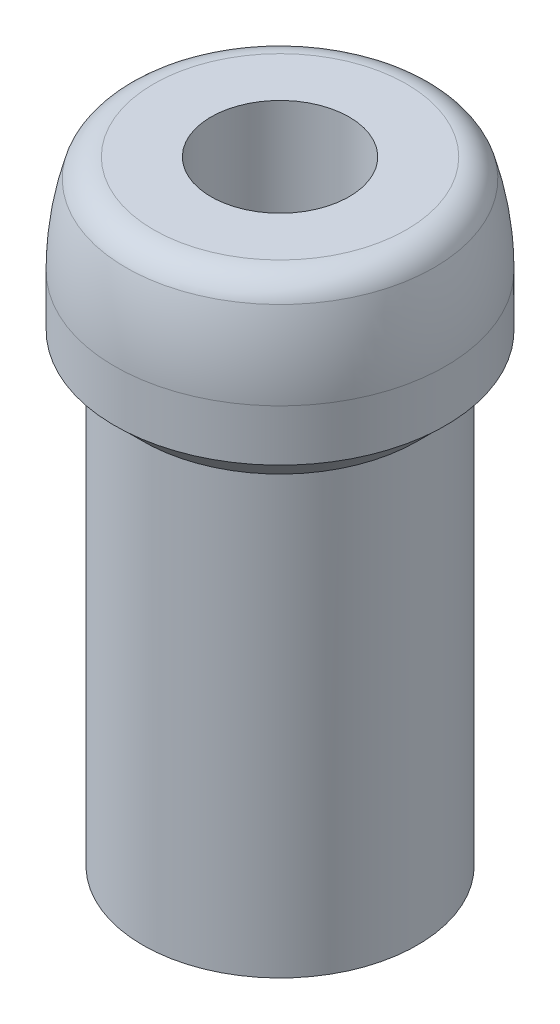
ISO-10303-21;
HEADER;
FILE_DESCRIPTION(('STEP AP214'),'2;1');
FILE_NAME('part.step','',(''),(''),'','','');
FILE_SCHEMA(('AUTOMOTIVE_DESIGN { 1 0 10303 214 1 1 1 1 }'));
ENDSEC;
DATA;
#1=APPLICATION_CONTEXT('core data for automotive mechanical design processes');
#2=APPLICATION_PROTOCOL_DEFINITION('international standard','automotive_design',2000,#1);
#3=PRODUCT_CONTEXT('',#1,'mechanical');
#4=PRODUCT('Part','Part','',(#3));
#5=PRODUCT_RELATED_PRODUCT_CATEGORY('part','',(#4));
#6=PRODUCT_DEFINITION_FORMATION('','',#4);
#7=PRODUCT_DEFINITION_CONTEXT('part definition',#1,'design');
#8=PRODUCT_DEFINITION('design','',#6,#7);
#9=PRODUCT_DEFINITION_SHAPE('','',#8);
#10=(LENGTH_UNIT() NAMED_UNIT(*) SI_UNIT(.MILLI.,.METRE.));
#11=(NAMED_UNIT(*) PLANE_ANGLE_UNIT() SI_UNIT($,.RADIAN.));
#12=(NAMED_UNIT(*) SI_UNIT($,.STERADIAN.) SOLID_ANGLE_UNIT());
#13=UNCERTAINTY_MEASURE_WITH_UNIT(LENGTH_MEASURE(1.E-05),#10,'distance_accuracy_value','');
#14=(GEOMETRIC_REPRESENTATION_CONTEXT(3) GLOBAL_UNCERTAINTY_ASSIGNED_CONTEXT((#13)) GLOBAL_UNIT_ASSIGNED_CONTEXT((#10,
#11,#12)) REPRESENTATION_CONTEXT('',''));
#15=CARTESIAN_POINT('',(0.,0.,0.));
#16=DIRECTION('',(0.,0.,1.));
#17=DIRECTION('',(1.,0.,0.));
#18=AXIS2_PLACEMENT_3D('',#15,#16,#17);
#19=CARTESIAN_POINT('',(0.,23.5,0.));
#20=DIRECTION('',(0.,-1.,0.));
#21=DIRECTION('',(0.,0.,-1.));
#22=AXIS2_PLACEMENT_3D('',#19,#20,#21);
#23=CYLINDRICAL_SURFACE('',#22,6.95);
#24=CARTESIAN_POINT('',(0.,22.1,0.));
#25=DIRECTION('',(0.,-1.,0.));
#26=DIRECTION('',(0.,0.,-1.));
#27=AXIS2_PLACEMENT_3D('',#24,#25,#26);
#28=CIRCLE('',#27,6.95);
#29=CARTESIAN_POINT('',(0.,22.1,-6.95));
#30=VERTEX_POINT('',#29);
#31=EDGE_CURVE('E10',#30,#30,#28,.T.);
#32=ORIENTED_EDGE('',*,*,#31,.T.);
#33=EDGE_LOOP('',(#32));
#34=FACE_BOUND('',#33,.T.);
#35=CARTESIAN_POINT('',(0.,0.,0.));
#36=DIRECTION('',(0.,1.,0.));
#37=DIRECTION('',(0.,0.,1.));
#38=AXIS2_PLACEMENT_3D('',#35,#36,#37);
#39=CIRCLE('',#38,6.95);
#40=CARTESIAN_POINT('',(0.,0.,6.95));
#41=VERTEX_POINT('',#40);
#42=EDGE_CURVE('E44',#41,#41,#39,.T.);
#43=ORIENTED_EDGE('',*,*,#42,.T.);
#44=EDGE_LOOP('',(#43));
#45=FACE_BOUND('',#44,.T.);
#46=ADVANCED_FACE('F33',(#34,#45),#23,.T.);
#47=CARTESIAN_POINT('',(0.,0.,0.));
#48=DIRECTION('',(0.,1.,0.));
#49=DIRECTION('',(0.,0.,1.));
#50=AXIS2_PLACEMENT_3D('',#47,#48,#49);
#51=PLANE('',#50);
#52=CARTESIAN_POINT('',(0.,0.,0.));
#53=DIRECTION('',(0.,-1.,0.));
#54=DIRECTION('',(0.,0.,-1.));
#55=AXIS2_PLACEMENT_3D('',#52,#53,#54);
#56=CIRCLE('',#55,3.5);
#57=CARTESIAN_POINT('',(0.,0.,-3.5));
#58=VERTEX_POINT('',#57);
#59=EDGE_CURVE('E63',#58,#58,#56,.T.);
#60=ORIENTED_EDGE('',*,*,#59,.F.);
#61=EDGE_LOOP('',(#60));
#62=FACE_BOUND('',#61,.T.);
#63=ORIENTED_EDGE('',*,*,#42,.F.);
#64=EDGE_LOOP('',(#63));
#65=FACE_BOUND('',#64,.T.);
#66=ADVANCED_FACE('F78',(#62,#65),#51,.F.);
#67=CARTESIAN_POINT('',(0.,23.5,0.));
#68=DIRECTION('',(0.,-1.,0.));
#69=DIRECTION('',(1.,0.,0.));
#70=AXIS2_PLACEMENT_3D('',#67,#68,#69);
#71=PLANE('',#70);
#72=CARTESIAN_POINT('',(0.,23.5,0.));
#73=DIRECTION('',(0.,-1.,0.));
#74=DIRECTION('',(1.,0.,0.));
#75=AXIS2_PLACEMENT_3D('',#72,#73,#74);
#76=CIRCLE('',#75,8.35000000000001);
#77=CARTESIAN_POINT('',(8.35000000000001,23.5,0.));
#78=VERTEX_POINT('',#77);
#79=EDGE_CURVE('E40',#78,#78,#76,.F.);
#80=ORIENTED_EDGE('',*,*,#79,.T.);
#81=EDGE_LOOP('',(#80));
#82=FACE_BOUND('',#81,.T.);
#83=CARTESIAN_POINT('',(0.,23.5,0.));
#84=DIRECTION('',(0.,1.,0.));
#85=DIRECTION('',(-1.,0.,0.));
#86=AXIS2_PLACEMENT_3D('',#83,#84,#85);
#87=CIRCLE('',#86,8.37757243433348);
#88=CARTESIAN_POINT('',(-8.37757243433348,23.5,0.));
#89=VERTEX_POINT('',#88);
#90=EDGE_CURVE('E48',#89,#89,#87,.T.);
#91=ORIENTED_EDGE('',*,*,#90,.F.);
#92=EDGE_LOOP('',(#91));
#93=FACE_BOUND('',#92,.T.);
#94=ADVANCED_FACE('F81',(#82,#93),#71,.T.);
#95=CARTESIAN_POINT('',(0.,31.1,0.));
#96=DIRECTION('',(0.,1.,0.));
#97=DIRECTION('',(-1.,0.,0.));
#98=AXIS2_PLACEMENT_3D('',#95,#96,#97);
#99=CYLINDRICAL_SURFACE('',#98,8.37757243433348);
#100=ORIENTED_EDGE('',*,*,#90,.T.);
#101=EDGE_LOOP('',(#100));
#102=FACE_BOUND('',#101,.T.);
#103=CARTESIAN_POINT('',(0.,26.1,0.));
#104=DIRECTION('',(0.,1.,0.));
#105=DIRECTION('',(-1.,0.,0.));
#106=AXIS2_PLACEMENT_3D('',#103,#104,#105);
#107=CIRCLE('',#106,8.37757243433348);
#108=CARTESIAN_POINT('',(-8.37757243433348,26.1,0.));
#109=VERTEX_POINT('',#108);
#110=EDGE_CURVE('E53',#109,#109,#107,.T.);
#111=ORIENTED_EDGE('',*,*,#110,.F.);
#112=EDGE_LOOP('',(#111));
#113=FACE_BOUND('',#112,.T.);
#114=ADVANCED_FACE('F91',(#102,#113),#99,.T.);
#115=CARTESIAN_POINT('',(0.,26.1583528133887,0.));
#116=DIRECTION('',(0.,1.,0.));
#117=DIRECTION('',(-1.,0.,0.));
#118=AXIS2_PLACEMENT_3D('',#115,#116,#117);
#119=DEGENERATE_TOROIDAL_SURFACE('',#118,5.62230595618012,14.,.F.);
#120=ORIENTED_EDGE('',*,*,#110,.T.);
#121=EDGE_LOOP('',(#120));
#122=FACE_BOUND('',#121,.T.);
#123=CARTESIAN_POINT('',(0.,30.1385164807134,0.));
#124=DIRECTION('',(0.,1.,0.));
#125=DIRECTION('',(-1.,0.,0.));
#126=AXIS2_PLACEMENT_3D('',#123,#124,#125);
#127=CIRCLE('',#126,7.8);
#128=CARTESIAN_POINT('',(-7.8,30.1385164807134,0.));
#129=VERTEX_POINT('',#128);
#130=EDGE_CURVE('E56',#129,#129,#127,.T.);
#131=ORIENTED_EDGE('',*,*,#130,.F.);
#132=EDGE_LOOP('',(#131));
#133=FACE_BOUND('',#132,.T.);
#134=ADVANCED_FACE('F94',(#122,#133),#119,.F.);
#135=CARTESIAN_POINT('',(0.,29.6,0.));
#136=DIRECTION('',(0.,1.,0.));
#137=DIRECTION('',(-1.,0.,0.));
#138=AXIS2_PLACEMENT_3D('',#135,#136,#137);
#139=TOROIDAL_SURFACE('',#138,6.4,1.5);
#140=ORIENTED_EDGE('',*,*,#130,.T.);
#141=EDGE_LOOP('',(#140));
#142=FACE_BOUND('',#141,.T.);
#143=CARTESIAN_POINT('',(0.,31.1,0.));
#144=DIRECTION('',(0.,1.,0.));
#145=DIRECTION('',(-1.,0.,0.));
#146=AXIS2_PLACEMENT_3D('',#143,#144,#145);
#147=CIRCLE('',#146,6.4);
#148=CARTESIAN_POINT('',(-6.4,31.1,0.));
#149=VERTEX_POINT('',#148);
#150=EDGE_CURVE('E59',#149,#149,#147,.T.);
#151=ORIENTED_EDGE('',*,*,#150,.F.);
#152=EDGE_LOOP('',(#151));
#153=FACE_BOUND('',#152,.T.);
#154=ADVANCED_FACE('F98',(#142,#153),#139,.T.);
#155=CARTESIAN_POINT('',(-6.4,31.1,0.));
#156=DIRECTION('',(0.,1.,0.));
#157=DIRECTION('',(-1.,0.,0.));
#158=AXIS2_PLACEMENT_3D('',#155,#156,#157);
#159=PLANE('',#158);
#160=CARTESIAN_POINT('',(0.,31.1,0.));
#161=DIRECTION('',(0.,-1.,0.));
#162=DIRECTION('',(0.,0.,-1.));
#163=AXIS2_PLACEMENT_3D('',#160,#161,#162);
#164=CIRCLE('',#163,3.5);
#165=CARTESIAN_POINT('',(0.,31.1,-3.5));
#166=VERTEX_POINT('',#165);
#167=EDGE_CURVE('E62',#166,#166,#164,.T.);
#168=ORIENTED_EDGE('',*,*,#167,.T.);
#169=EDGE_LOOP('',(#168));
#170=FACE_BOUND('',#169,.T.);
#171=ORIENTED_EDGE('',*,*,#150,.T.);
#172=EDGE_LOOP('',(#171));
#173=FACE_BOUND('',#172,.T.);
#174=ADVANCED_FACE('F69',(#170,#173),#159,.T.);
#175=CARTESIAN_POINT('',(0.,23.5,0.));
#176=DIRECTION('',(0.,1.,0.));
#177=DIRECTION('',(0.,0.,1.));
#178=AXIS2_PLACEMENT_3D('',#175,#176,#177);
#179=CONICAL_SURFACE('',#178,8.35000000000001,0.785398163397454);
#180=ORIENTED_EDGE('',*,*,#31,.F.);
#181=EDGE_LOOP('',(#180));
#182=FACE_BOUND('',#181,.T.);
#183=ORIENTED_EDGE('',*,*,#79,.F.);
#184=EDGE_LOOP('',(#183));
#185=FACE_BOUND('',#184,.T.);
#186=ADVANCED_FACE('F35',(#182,#185),#179,.T.);
#187=CARTESIAN_POINT('',(0.,31.1,0.));
#188=DIRECTION('',(0.,-1.,0.));
#189=DIRECTION('',(0.,0.,-1.));
#190=AXIS2_PLACEMENT_3D('',#187,#188,#189);
#191=CYLINDRICAL_SURFACE('',#190,3.5);
#192=CARTESIAN_POINT('',(0.,31.1,-3.5));
#193=CARTESIAN_POINT('',(0.,30.7760416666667,-3.5));
#194=CARTESIAN_POINT('',(0.,30.4520833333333,-3.5));
#195=CARTESIAN_POINT('',(0.,29.8041666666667,-3.5));
#196=CARTESIAN_POINT('',(0.,29.4802083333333,-3.5));
#197=CARTESIAN_POINT('',(0.,28.8322916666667,-3.5));
#198=CARTESIAN_POINT('',(0.,28.5083333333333,-3.5));
#199=CARTESIAN_POINT('',(0.,27.8604166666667,-3.5));
#200=CARTESIAN_POINT('',(0.,27.5364583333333,-3.5));
#201=CARTESIAN_POINT('',(0.,26.8885416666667,-3.5));
#202=CARTESIAN_POINT('',(0.,26.5645833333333,-3.5));
#203=CARTESIAN_POINT('',(0.,25.9166666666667,-3.5));
#204=CARTESIAN_POINT('',(0.,25.5927083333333,-3.5));
#205=CARTESIAN_POINT('',(0.,24.9447916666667,-3.5));
#206=CARTESIAN_POINT('',(0.,24.6208333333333,-3.5));
#207=CARTESIAN_POINT('',(0.,23.9729166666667,-3.5));
#208=CARTESIAN_POINT('',(0.,23.6489583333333,-3.5));
#209=CARTESIAN_POINT('',(0.,23.0010416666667,-3.5));
#210=CARTESIAN_POINT('',(0.,22.6770833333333,-3.5));
#211=CARTESIAN_POINT('',(0.,22.0291666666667,-3.5));
#212=CARTESIAN_POINT('',(0.,21.7052083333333,-3.5));
#213=CARTESIAN_POINT('',(0.,21.0572916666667,-3.5));
#214=CARTESIAN_POINT('',(0.,20.7333333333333,-3.5));
#215=CARTESIAN_POINT('',(0.,20.0854166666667,-3.5));
#216=CARTESIAN_POINT('',(0.,19.7614583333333,-3.5));
#217=CARTESIAN_POINT('',(0.,19.1135416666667,-3.5));
#218=CARTESIAN_POINT('',(0.,18.7895833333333,-3.5));
#219=CARTESIAN_POINT('',(0.,18.1416666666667,-3.5));
#220=CARTESIAN_POINT('',(0.,17.8177083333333,-3.5));
#221=CARTESIAN_POINT('',(0.,17.1697916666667,-3.5));
#222=CARTESIAN_POINT('',(0.,16.8458333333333,-3.5));
#223=CARTESIAN_POINT('',(0.,16.1979166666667,-3.5));
#224=CARTESIAN_POINT('',(0.,15.8739583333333,-3.5));
#225=CARTESIAN_POINT('',(0.,15.2260416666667,-3.5));
#226=CARTESIAN_POINT('',(0.,14.9020833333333,-3.5));
#227=CARTESIAN_POINT('',(0.,14.2541666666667,-3.5));
#228=CARTESIAN_POINT('',(0.,13.9302083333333,-3.5));
#229=CARTESIAN_POINT('',(0.,13.2822916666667,-3.5));
#230=CARTESIAN_POINT('',(0.,12.9583333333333,-3.5));
#231=CARTESIAN_POINT('',(0.,12.3104166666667,-3.5));
#232=CARTESIAN_POINT('',(0.,11.9864583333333,-3.5));
#233=CARTESIAN_POINT('',(0.,11.3385416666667,-3.5));
#234=CARTESIAN_POINT('',(0.,11.0145833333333,-3.5));
#235=CARTESIAN_POINT('',(0.,10.3666666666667,-3.5));
#236=CARTESIAN_POINT('',(0.,10.0427083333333,-3.5));
#237=CARTESIAN_POINT('',(0.,9.39479166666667,-3.5));
#238=CARTESIAN_POINT('',(0.,9.07083333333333,-3.5));
#239=CARTESIAN_POINT('',(0.,8.42291666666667,-3.5));
#240=CARTESIAN_POINT('',(0.,8.09895833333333,-3.5));
#241=CARTESIAN_POINT('',(0.,7.45104166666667,-3.5));
#242=CARTESIAN_POINT('',(0.,7.12708333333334,-3.5));
#243=CARTESIAN_POINT('',(0.,6.47916666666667,-3.5));
#244=CARTESIAN_POINT('',(0.,6.15520833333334,-3.5));
#245=CARTESIAN_POINT('',(0.,5.50729166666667,-3.5));
#246=CARTESIAN_POINT('',(0.,5.18333333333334,-3.5));
#247=CARTESIAN_POINT('',(0.,4.53541666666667,-3.5));
#248=CARTESIAN_POINT('',(0.,4.21145833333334,-3.5));
#249=CARTESIAN_POINT('',(0.,3.56354166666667,-3.5));
#250=CARTESIAN_POINT('',(0.,3.23958333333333,-3.5));
#251=CARTESIAN_POINT('',(0.,2.59166666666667,-3.5));
#252=CARTESIAN_POINT('',(0.,2.26770833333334,-3.5));
#253=CARTESIAN_POINT('',(0.,1.61979166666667,-3.5));
#254=CARTESIAN_POINT('',(0.,1.29583333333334,-3.5));
#255=CARTESIAN_POINT('',(0.,0.647916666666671,-3.5));
#256=CARTESIAN_POINT('',(0.,0.323958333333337,-3.5));
#257=CARTESIAN_POINT('',(0.,0.,-3.5));
#258=B_SPLINE_CURVE_WITH_KNOTS('',3,(#192,#193,#194,#195,#196,#197,#198,#199,#200,#201,#202,
#203,#204,#205,#206,#207,#208,#209,#210,#211,#212,#213,#214,#215,#216,#217,#218,#219,#220,#221,
#222,#223,#224,#225,#226,#227,#228,#229,#230,#231,#232,#233,#234,#235,#236,#237,#238,#239,#240,
#241,#242,#243,#244,#245,#246,#247,#248,#249,#250,#251,#252,#253,#254,#255,#256,#257),
.UNSPECIFIED.,.F.,.F.,(4,2,2,2,2,2,2,2,2,2,2,2,2,2,2,2,2,2,2,2,2,2,2,2,2,2,2,2,2,2,2,2,4),(0.,
0.971874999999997,1.94375,2.915625,3.8875,4.859375,5.83125,6.803125,7.775,8.74687499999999,
9.71874999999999,10.690625,11.6625,12.634375,13.60625,14.578125,15.55,16.521875,17.49375,
18.465625,19.4375,20.409375,21.38125,22.353125,23.325,24.296875,25.26875,26.240625,27.2125,
28.184375,29.15625,30.128125,31.1),.UNSPECIFIED.);
#259=EDGE_CURVE('BSEAM72',#166,#58,#258,.T.);
#260=ORIENTED_EDGE('',*,*,#167,.F.);
#261=ORIENTED_EDGE('',*,*,#59,.T.);
#262=ORIENTED_EDGE('',*,*,#259,.T.);
#263=ORIENTED_EDGE('',*,*,#259,.F.);
#264=EDGE_LOOP('',(#260,#262,#261,#263));
#265=FACE_BOUND('',#264,.T.);
#266=ADVANCED_FACE('F72',(#265),#191,.F.);
#267=CLOSED_SHELL('',(#46,#66,#94,#114,#134,#154,#174,#186,#266));
#268=MANIFOLD_SOLID_BREP('B2',#267);
#269=ADVANCED_BREP_SHAPE_REPRESENTATION('',(#18,#268),#14);
#270=SHAPE_DEFINITION_REPRESENTATION(#9,#269);
ENDSEC;
END-ISO-10303-21;
